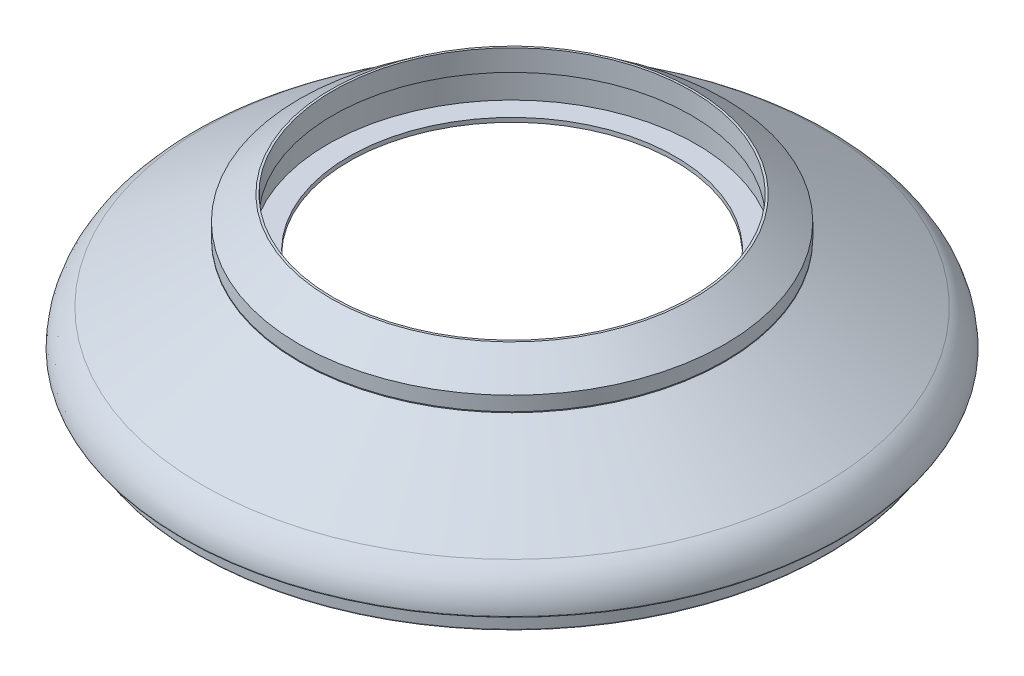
from build123d import *


with BuildPart() as part:
    # Sketch1 → Revolve1 (revolve)
    with BuildSketch(Plane.XY, mode=Mode.PRIVATE) as revolve1_sk:
        with BuildLine():
            Line((-108.2167, 29.21), (-106.9467, 29.21))
            Line((-106.9467, 29.21), (-106.9467, 16.51))
            Line((-106.9467, 16.51), (-110.0455, 16.51))
            Line((-110.0455, 16.51), (-110.0455, 0))
            Line((-110.0455, 0), (-97.3455, 0))
            Line((-97.3455, 0), (-97.3455, -2.54))
            Line((-97.3455, -2.54), (-169.966259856, -41.207031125))
            ThreePointArc((-169.966259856, -41.207031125), (-179.611793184, -50.235558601), (-183.41793807, -62.887194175))
            ThreePointArc((-183.41793807, -62.887194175), (-183.648704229, -63.411605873), (-184.179614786, -63.627))
            Line((-184.179614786, -63.627), (-187.354614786, -63.627))
            ThreePointArc((-187.354614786, -63.627), (-187.893430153, -63.403815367), (-188.116614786, -62.865))
            Line((-188.116614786, -62.865), (-188.116614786, -56.007))
            ThreePointArc((-188.116614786, -56.007), (-189.604512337, -52.414897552), (-193.196614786, -50.927))
            Line((-193.196614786, -50.927), (-196.088364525, -50.927))
            ThreePointArc((-196.088364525, -50.927), (-196.635448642, -50.695417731), (-196.85, -50.14143299))
            ThreePointArc((-196.85, -50.14143299), (-193.407405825, -38.137716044), (-184.660456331, -29.225278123))
            Line((-184.660456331, -29.225278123), (-127, 5.842))
            Line((-127, 5.842), (-119.600516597, 5.842))
            Line((-119.600516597, 5.842), (-119.600516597, 6.35))
            Line((-119.600516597, 6.35), (-127, 6.35))
            Line((-127, 6.35), (-127, 14.894699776))
            Line((-127, 14.894699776), (-108.2167, 29.21))
        make_face()
    revolve(revolve1_sk.sketch.rotate(Axis((0, 40.224442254, 0), (0, -1, 0)), 270), axis=Axis((0, 40.224442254, 0), (0, -1, 0)))


solid = part.part
